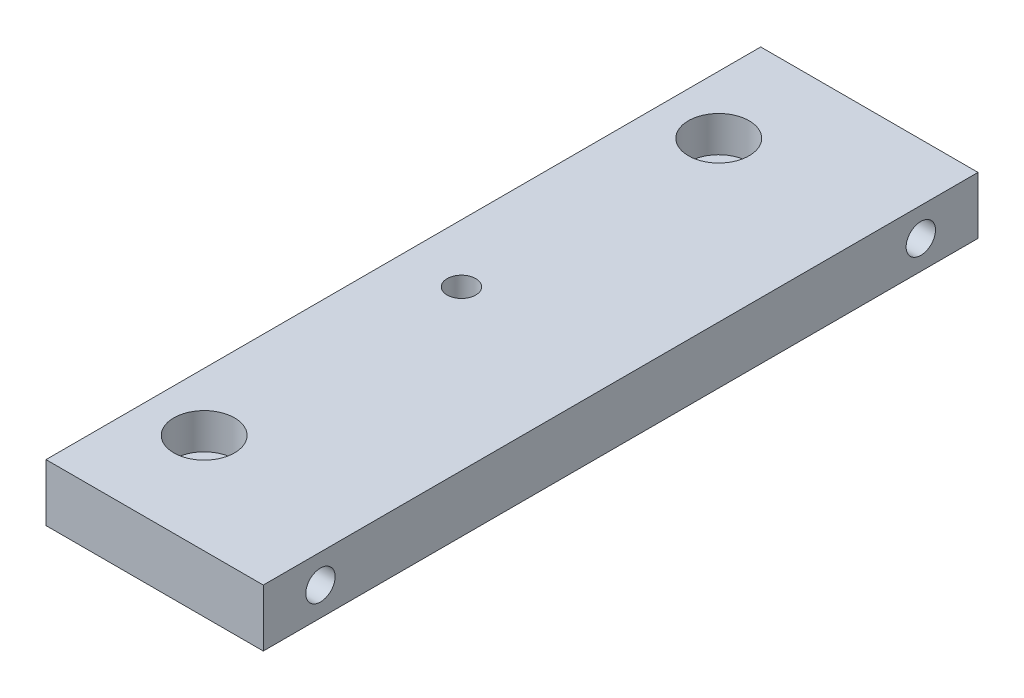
from build123d import *

# Parameters (mm, degrees)
SKETCH1_W                                        = 48.26
SKETCH1_H                                        = 158.75
BOSS_EXTRUDE1_DEPTH                              = 6.35
CBORE_FOR_1_4_SOCKET_HEAD_CAP_SCREW1_D           = 8.4328
CBORE_FOR_1_4_SOCKET_HEAD_CAP_SCREW1_CBORE_D     = 13.49502
CBORE_FOR_1_4_SOCKET_HEAD_CAP_SCREW1_CBORE_DEPTH = 7.9375
F_1_4_0_2500_DOWEL_HOLE1_D                       = 6.35
F_5_16_18_TAPPED_HOLE1_D                         = 6.5278
F_5_16_18_TAPPED_HOLE1_DEPTH                     = 20.32
F_5_16_18_TAPPED_HOLE1_TIP                       = 1.961148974


with BuildPart() as part:
    # Sketch1 → Boss-Extrude1 (new, symmetric)
    with BuildSketch(Plane(origin=(0, 0, 0), x_dir=(1, 0, 0), z_dir=(0, 1, 0))):
        Rectangle(SKETCH1_W, SKETCH1_H)
    extrude(amount=BOSS_EXTRUDE1_DEPTH, both=True)

    # CBORE for 1_4 Socket Head Cap Screw1 (through all)
    with Locations(Plane(origin=(0, 6.35, 0), x_dir=(1, 0, 0), z_dir=(0, 1, 0))):
        with Locations((-11.22520742, -57.15), (-11.22520742, 57.15)):
            CounterBoreHole(CBORE_FOR_1_4_SOCKET_HEAD_CAP_SCREW1_D / 2, CBORE_FOR_1_4_SOCKET_HEAD_CAP_SCREW1_CBORE_D / 2, CBORE_FOR_1_4_SOCKET_HEAD_CAP_SCREW1_CBORE_DEPTH)

    # 1_4 _0.2500_ Dowel Hole1 (through all)
    with Locations(Plane(origin=(0, -6.35, 0), x_dir=(-1, 0, 0), z_dir=(0, -1, 0))):
        with Locations((11.22520742, 0)):
            Hole(F_1_4_0_2500_DOWEL_HOLE1_D / 2)

    # 5_16-18 Tapped Hole1
    with Locations(Plane(origin=(24.13, 0, 0), x_dir=(0, 0, -1), z_dir=(1, 0, 0))):
        with Locations((66.675, 0), (-66.675, 0)):
            Hole(F_5_16_18_TAPPED_HOLE1_D / 2, depth=F_5_16_18_TAPPED_HOLE1_DEPTH)
            with Locations((0, 0, -(F_5_16_18_TAPPED_HOLE1_DEPTH + F_5_16_18_TAPPED_HOLE1_TIP / 2))):  # 118° drill point
                Cone(0, F_5_16_18_TAPPED_HOLE1_D / 2, F_5_16_18_TAPPED_HOLE1_TIP, mode=Mode.SUBTRACT)


solid = part.part
